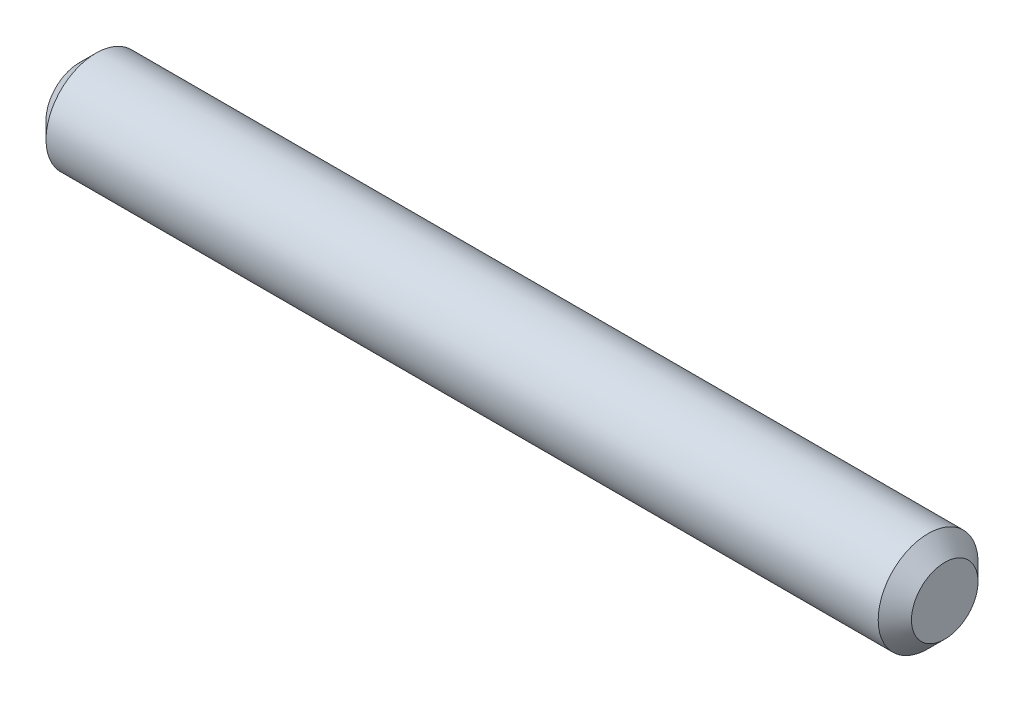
ISO-10303-21;
HEADER;
FILE_DESCRIPTION(('STEP AP214'),'2;1');
FILE_NAME('part.step','',(''),(''),'','','');
FILE_SCHEMA(('AUTOMOTIVE_DESIGN { 1 0 10303 214 1 1 1 1 }'));
ENDSEC;
DATA;
#1=APPLICATION_CONTEXT('core data for automotive mechanical design processes');
#2=APPLICATION_PROTOCOL_DEFINITION('international standard','automotive_design',2000,#1);
#3=PRODUCT_CONTEXT('',#1,'mechanical');
#4=PRODUCT('Part','Part','',(#3));
#5=PRODUCT_RELATED_PRODUCT_CATEGORY('part','',(#4));
#6=PRODUCT_DEFINITION_FORMATION('','',#4);
#7=PRODUCT_DEFINITION_CONTEXT('part definition',#1,'design');
#8=PRODUCT_DEFINITION('design','',#6,#7);
#9=PRODUCT_DEFINITION_SHAPE('','',#8);
#10=(LENGTH_UNIT() NAMED_UNIT(*) SI_UNIT(.MILLI.,.METRE.));
#11=(NAMED_UNIT(*) PLANE_ANGLE_UNIT() SI_UNIT($,.RADIAN.));
#12=(NAMED_UNIT(*) SI_UNIT($,.STERADIAN.) SOLID_ANGLE_UNIT());
#13=UNCERTAINTY_MEASURE_WITH_UNIT(LENGTH_MEASURE(1.E-05),#10,'distance_accuracy_value','');
#14=(GEOMETRIC_REPRESENTATION_CONTEXT(3) GLOBAL_UNCERTAINTY_ASSIGNED_CONTEXT((#13)) GLOBAL_UNIT_ASSIGNED_CONTEXT((#10,
#11,#12)) REPRESENTATION_CONTEXT('',''));
#15=CARTESIAN_POINT('',(0.,0.,0.));
#16=DIRECTION('',(0.,0.,1.));
#17=DIRECTION('',(1.,0.,0.));
#18=AXIS2_PLACEMENT_3D('',#15,#16,#17);
#19=CARTESIAN_POINT('',(-13.,0.,0.));
#20=DIRECTION('',(1.,0.,0.));
#21=DIRECTION('',(0.,0.,-1.));
#22=AXIS2_PLACEMENT_3D('',#19,#20,#21);
#23=PLANE('',#22);
#24=CARTESIAN_POINT('',(-13.,0.,0.));
#25=DIRECTION('',(-1.,0.,0.));
#26=DIRECTION('',(0.,0.,1.));
#27=AXIS2_PLACEMENT_3D('',#24,#25,#26);
#28=CIRCLE('',#27,1.);
#29=CARTESIAN_POINT('',(-13.,0.,1.));
#30=VERTEX_POINT('',#29);
#31=EDGE_CURVE('E10',#30,#30,#28,.T.);
#32=ORIENTED_EDGE('',*,*,#31,.T.);
#33=EDGE_LOOP('',(#32));
#34=FACE_BOUND('',#33,.T.);
#35=ADVANCED_FACE('F33',(#34),#23,.F.);
#36=CARTESIAN_POINT('',(-12.5,0.,0.));
#37=DIRECTION('',(1.,0.,0.));
#38=DIRECTION('',(0.,0.,-1.));
#39=AXIS2_PLACEMENT_3D('',#36,#37,#38);
#40=CONICAL_SURFACE('',#39,1.5,0.785398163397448);
#41=ORIENTED_EDGE('',*,*,#31,.F.);
#42=EDGE_LOOP('',(#41));
#43=FACE_BOUND('',#42,.T.);
#44=CARTESIAN_POINT('',(-12.5,0.,0.));
#45=DIRECTION('',(-1.,0.,0.));
#46=DIRECTION('',(0.,0.,1.));
#47=AXIS2_PLACEMENT_3D('',#44,#45,#46);
#48=CIRCLE('',#47,1.5);
#49=CARTESIAN_POINT('',(-12.5,0.,1.5));
#50=VERTEX_POINT('',#49);
#51=EDGE_CURVE('E39',#50,#50,#48,.T.);
#52=ORIENTED_EDGE('',*,*,#51,.T.);
#53=EDGE_LOOP('',(#52));
#54=FACE_BOUND('',#53,.T.);
#55=ADVANCED_FACE('F65',(#43,#54),#40,.T.);
#56=CARTESIAN_POINT('',(-13.,0.,0.));
#57=DIRECTION('',(-1.,0.,0.));
#58=DIRECTION('',(0.,0.,1.));
#59=AXIS2_PLACEMENT_3D('',#56,#57,#58);
#60=CYLINDRICAL_SURFACE('',#59,1.5);
#61=ORIENTED_EDGE('',*,*,#51,.F.);
#62=EDGE_LOOP('',(#61));
#63=FACE_BOUND('',#62,.T.);
#64=CARTESIAN_POINT('',(12.5,0.,0.));
#65=DIRECTION('',(-1.,0.,0.));
#66=DIRECTION('',(0.,0.,1.));
#67=AXIS2_PLACEMENT_3D('',#64,#65,#66);
#68=CIRCLE('',#67,1.5);
#69=CARTESIAN_POINT('',(12.5,0.,1.5));
#70=VERTEX_POINT('',#69);
#71=EDGE_CURVE('E43',#70,#70,#68,.T.);
#72=ORIENTED_EDGE('',*,*,#71,.T.);
#73=EDGE_LOOP('',(#72));
#74=FACE_BOUND('',#73,.T.);
#75=ADVANCED_FACE('F61',(#63,#74),#60,.T.);
#76=CARTESIAN_POINT('',(13.,0.,0.));
#77=DIRECTION('',(-1.,0.,0.));
#78=DIRECTION('',(0.,0.,1.));
#79=AXIS2_PLACEMENT_3D('',#76,#77,#78);
#80=CONICAL_SURFACE('',#79,1.,0.785398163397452);
#81=ORIENTED_EDGE('',*,*,#71,.F.);
#82=EDGE_LOOP('',(#81));
#83=FACE_BOUND('',#82,.T.);
#84=CARTESIAN_POINT('',(13.,0.,0.));
#85=DIRECTION('',(-1.,0.,0.));
#86=DIRECTION('',(0.,0.,1.));
#87=AXIS2_PLACEMENT_3D('',#84,#85,#86);
#88=CIRCLE('',#87,1.);
#89=CARTESIAN_POINT('',(13.,0.,1.));
#90=VERTEX_POINT('',#89);
#91=EDGE_CURVE('E47',#90,#90,#88,.T.);
#92=ORIENTED_EDGE('',*,*,#91,.T.);
#93=EDGE_LOOP('',(#92));
#94=FACE_BOUND('',#93,.T.);
#95=ADVANCED_FACE('F53',(#83,#94),#80,.T.);
#96=CARTESIAN_POINT('',(13.,0.999999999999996,0.));
#97=DIRECTION('',(-1.,0.,0.));
#98=DIRECTION('',(0.,0.,1.));
#99=AXIS2_PLACEMENT_3D('',#96,#97,#98);
#100=PLANE('',#99);
#101=ORIENTED_EDGE('',*,*,#91,.F.);
#102=EDGE_LOOP('',(#101));
#103=FACE_BOUND('',#102,.T.);
#104=ADVANCED_FACE('F55',(#103),#100,.F.);
#105=CLOSED_SHELL('',(#35,#55,#75,#95,#104));
#106=MANIFOLD_SOLID_BREP('B2',#105);
#107=ADVANCED_BREP_SHAPE_REPRESENTATION('',(#18,#106),#14);
#108=SHAPE_DEFINITION_REPRESENTATION(#9,#107);
ENDSEC;
END-ISO-10303-21;
